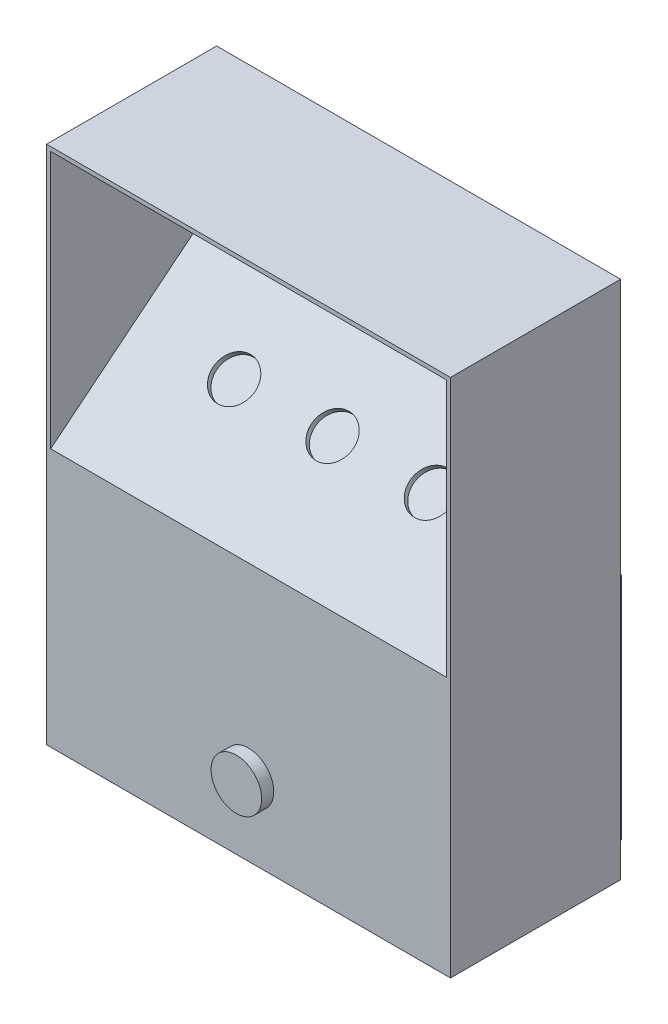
ISO-10303-21;
HEADER;
FILE_DESCRIPTION(('STEP AP214'),'2;1');
FILE_NAME('part.step','',(''),(''),'','','');
FILE_SCHEMA(('AUTOMOTIVE_DESIGN { 1 0 10303 214 1 1 1 1 }'));
ENDSEC;
DATA;
#1=APPLICATION_CONTEXT('core data for automotive mechanical design processes');
#2=APPLICATION_PROTOCOL_DEFINITION('international standard','automotive_design',2000,#1);
#3=PRODUCT_CONTEXT('',#1,'mechanical');
#4=PRODUCT('Part','Part','',(#3));
#5=PRODUCT_RELATED_PRODUCT_CATEGORY('part','',(#4));
#6=PRODUCT_DEFINITION_FORMATION('','',#4);
#7=PRODUCT_DEFINITION_CONTEXT('part definition',#1,'design');
#8=PRODUCT_DEFINITION('design','',#6,#7);
#9=PRODUCT_DEFINITION_SHAPE('','',#8);
#10=(LENGTH_UNIT() NAMED_UNIT(*) SI_UNIT(.MILLI.,.METRE.));
#11=(NAMED_UNIT(*) PLANE_ANGLE_UNIT() SI_UNIT($,.RADIAN.));
#12=(NAMED_UNIT(*) SI_UNIT($,.STERADIAN.) SOLID_ANGLE_UNIT());
#13=UNCERTAINTY_MEASURE_WITH_UNIT(LENGTH_MEASURE(1.E-05),#10,'distance_accuracy_value','');
#14=(GEOMETRIC_REPRESENTATION_CONTEXT(3) GLOBAL_UNCERTAINTY_ASSIGNED_CONTEXT((#13)) GLOBAL_UNIT_ASSIGNED_CONTEXT((#10,
#11,#12)) REPRESENTATION_CONTEXT('',''));
#15=CARTESIAN_POINT('',(0.,0.,0.));
#16=DIRECTION('',(0.,0.,1.));
#17=DIRECTION('',(1.,0.,0.));
#18=AXIS2_PLACEMENT_3D('',#15,#16,#17);
#19=CARTESIAN_POINT('',(0.,0.,0.));
#20=DIRECTION('',(0.,0.,1.));
#21=DIRECTION('',(1.,0.,0.));
#22=AXIS2_PLACEMENT_3D('',#19,#20,#21);
#23=PLANE('',#22);
#24=DIRECTION('',(0.,-1.,0.));
#25=VECTOR('',#24,1.);
#26=CARTESIAN_POINT('',(75.7809,103.555799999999,0.));
#27=LINE('',#26,#25);
#28=CARTESIAN_POINT('',(75.7809,103.555799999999,0.));
#29=VERTEX_POINT('',#28);
#30=CARTESIAN_POINT('',(75.7809,0.,0.));
#31=VERTEX_POINT('',#30);
#32=EDGE_CURVE('E69',#29,#31,#27,.T.);
#33=ORIENTED_EDGE('',*,*,#32,.F.);
#34=DIRECTION('',(1.,0.,0.));
#35=VECTOR('',#34,1.);
#36=CARTESIAN_POINT('',(75.7809,103.555799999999,0.));
#37=LINE('',#36,#35);
#38=CARTESIAN_POINT('',(-75.7809,103.555799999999,0.));
#39=VERTEX_POINT('',#38);
#40=EDGE_CURVE('E219',#39,#29,#37,.T.);
#41=ORIENTED_EDGE('',*,*,#40,.F.);
#42=DIRECTION('',(0.,1.,0.));
#43=VECTOR('',#42,1.);
#44=CARTESIAN_POINT('',(-75.7809,103.555799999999,0.));
#45=LINE('',#44,#43);
#46=CARTESIAN_POINT('',(-75.7809,0.,0.));
#47=VERTEX_POINT('',#46);
#48=EDGE_CURVE('E231',#47,#39,#45,.T.);
#49=ORIENTED_EDGE('',*,*,#48,.F.);
#50=DIRECTION('',(1.,0.,0.));
#51=VECTOR('',#50,1.);
#52=CARTESIAN_POINT('',(-91.2368,0.,0.));
#53=LINE('',#52,#51);
#54=CARTESIAN_POINT('',(-91.2368,0.,0.));
#55=VERTEX_POINT('',#54);
#56=EDGE_CURVE('E272',#55,#47,#53,.T.);
#57=ORIENTED_EDGE('',*,*,#56,.F.);
#58=DIRECTION('',(0.,-1.,0.));
#59=VECTOR('',#58,1.);
#60=CARTESIAN_POINT('',(-91.2368,234.95,0.));
#61=LINE('',#60,#59);
#62=CARTESIAN_POINT('',(-91.2368,234.95,0.));
#63=VERTEX_POINT('',#62);
#64=EDGE_CURVE('E252',#63,#55,#61,.T.);
#65=ORIENTED_EDGE('',*,*,#64,.F.);
#66=DIRECTION('',(-1.,0.,0.));
#67=VECTOR('',#66,1.);
#68=CARTESIAN_POINT('',(-91.2368,234.95,0.));
#69=LINE('',#68,#67);
#70=CARTESIAN_POINT('',(91.2368,234.95,0.));
#71=VERTEX_POINT('',#70);
#72=EDGE_CURVE('E258',#71,#63,#69,.T.);
#73=ORIENTED_EDGE('',*,*,#72,.F.);
#74=DIRECTION('',(0.,1.,0.));
#75=VECTOR('',#74,1.);
#76=CARTESIAN_POINT('',(91.2368,234.95,0.));
#77=LINE('',#76,#75);
#78=CARTESIAN_POINT('',(91.2368,0.,0.));
#79=VERTEX_POINT('',#78);
#80=EDGE_CURVE('E276',#79,#71,#77,.T.);
#81=ORIENTED_EDGE('',*,*,#80,.F.);
#82=EDGE_CURVE('E271',#31,#79,#53,.T.);
#83=ORIENTED_EDGE('',*,*,#82,.F.);
#84=EDGE_LOOP('',(#33,#41,#49,#57,#65,#73,#81,#83));
#85=FACE_BOUND('',#84,.T.);
#86=ADVANCED_FACE('F39',(#85),#23,.F.);
#87=CARTESIAN_POINT('',(-91.2368,234.95,76.835));
#88=DIRECTION('',(1.,0.,0.));
#89=DIRECTION('',(0.,1.,0.));
#90=AXIS2_PLACEMENT_3D('',#87,#88,#89);
#91=PLANE('',#90);
#92=ORIENTED_EDGE('',*,*,#64,.T.);
#93=DIRECTION('',(0.,0.,-1.));
#94=VECTOR('',#93,1.);
#95=CARTESIAN_POINT('',(-91.2368,0.,76.835));
#96=LINE('',#95,#94);
#97=CARTESIAN_POINT('',(-91.2368,0.,76.835));
#98=VERTEX_POINT('',#97);
#99=EDGE_CURVE('E11',#98,#55,#96,.T.);
#100=ORIENTED_EDGE('',*,*,#99,.F.);
#101=DIRECTION('',(0.,-1.,0.));
#102=VECTOR('',#101,1.);
#103=CARTESIAN_POINT('',(-91.2368,234.95,76.835));
#104=LINE('',#103,#102);
#105=CARTESIAN_POINT('',(-91.2368,234.95,76.835));
#106=VERTEX_POINT('',#105);
#107=EDGE_CURVE('E253',#106,#98,#104,.T.);
#108=ORIENTED_EDGE('',*,*,#107,.F.);
#109=DIRECTION('',(0.,0.,-1.));
#110=VECTOR('',#109,1.);
#111=CARTESIAN_POINT('',(-91.2368,234.95,76.835));
#112=LINE('',#111,#110);
#113=EDGE_CURVE('E267',#106,#63,#112,.T.);
#114=ORIENTED_EDGE('',*,*,#113,.T.);
#115=EDGE_LOOP('',(#92,#100,#108,#114));
#116=FACE_BOUND('',#115,.T.);
#117=ADVANCED_FACE('F41',(#116),#91,.F.);
#118=CARTESIAN_POINT('',(-91.2368,0.,76.835));
#119=DIRECTION('',(0.,1.,0.));
#120=DIRECTION('',(0.,0.,1.));
#121=AXIS2_PLACEMENT_3D('',#118,#119,#120);
#122=PLANE('',#121);
#123=ORIENTED_EDGE('',*,*,#56,.T.);
#124=DIRECTION('',(0.,0.,1.));
#125=VECTOR('',#124,1.);
#126=CARTESIAN_POINT('',(-75.7809,0.,-15.8496));
#127=LINE('',#126,#125);
#128=CARTESIAN_POINT('',(-75.7809,0.,-15.8496));
#129=VERTEX_POINT('',#128);
#130=EDGE_CURVE('E244',#129,#47,#127,.T.);
#131=ORIENTED_EDGE('',*,*,#130,.F.);
#132=DIRECTION('',(-1.,0.,0.));
#133=VECTOR('',#132,1.);
#134=CARTESIAN_POINT('',(75.7809,0.,-15.8496));
#135=LINE('',#134,#133);
#136=CARTESIAN_POINT('',(75.7809,0.,-15.8496));
#137=VERTEX_POINT('',#136);
#138=EDGE_CURVE('E218',#137,#129,#135,.T.);
#139=ORIENTED_EDGE('',*,*,#138,.F.);
#140=DIRECTION('',(0.,0.,1.));
#141=VECTOR('',#140,1.);
#142=CARTESIAN_POINT('',(75.7809,0.,-15.8496));
#143=LINE('',#142,#141);
#144=EDGE_CURVE('E248',#137,#31,#143,.T.);
#145=ORIENTED_EDGE('',*,*,#144,.T.);
#146=ORIENTED_EDGE('',*,*,#82,.T.);
#147=DIRECTION('',(0.,0.,-1.));
#148=VECTOR('',#147,1.);
#149=CARTESIAN_POINT('',(91.2368,0.,76.835));
#150=LINE('',#149,#148);
#151=CARTESIAN_POINT('',(91.2368,0.,76.835));
#152=VERTEX_POINT('',#151);
#153=EDGE_CURVE('E48',#152,#79,#150,.T.);
#154=ORIENTED_EDGE('',*,*,#153,.F.);
#155=DIRECTION('',(1.,0.,0.));
#156=VECTOR('',#155,1.);
#157=CARTESIAN_POINT('',(-91.2368,0.,76.835));
#158=LINE('',#157,#156);
#159=EDGE_CURVE('E257',#98,#152,#158,.T.);
#160=ORIENTED_EDGE('',*,*,#159,.F.);
#161=ORIENTED_EDGE('',*,*,#99,.T.);
#162=EDGE_LOOP('',(#123,#131,#139,#145,#146,#154,#160,#161));
#163=FACE_BOUND('',#162,.T.);
#164=ADVANCED_FACE('F306',(#163),#122,.F.);
#165=CARTESIAN_POINT('',(91.2368,234.95,76.835));
#166=DIRECTION('',(-1.,0.,0.));
#167=DIRECTION('',(0.,-1.,0.));
#168=AXIS2_PLACEMENT_3D('',#165,#166,#167);
#169=PLANE('',#168);
#170=ORIENTED_EDGE('',*,*,#80,.T.);
#171=DIRECTION('',(0.,0.,-1.));
#172=VECTOR('',#171,1.);
#173=CARTESIAN_POINT('',(91.2368,234.95,76.835));
#174=LINE('',#173,#172);
#175=CARTESIAN_POINT('',(91.2368,234.95,76.835));
#176=VERTEX_POINT('',#175);
#177=EDGE_CURVE('E284',#176,#71,#174,.T.);
#178=ORIENTED_EDGE('',*,*,#177,.F.);
#179=DIRECTION('',(0.,1.,0.));
#180=VECTOR('',#179,1.);
#181=CARTESIAN_POINT('',(91.2368,234.95,76.835));
#182=LINE('',#181,#180);
#183=EDGE_CURVE('E261',#152,#176,#182,.T.);
#184=ORIENTED_EDGE('',*,*,#183,.F.);
#185=ORIENTED_EDGE('',*,*,#153,.T.);
#186=EDGE_LOOP('',(#170,#178,#184,#185));
#187=FACE_BOUND('',#186,.T.);
#188=ADVANCED_FACE('F294',(#187),#169,.F.);
#189=CARTESIAN_POINT('',(-91.2368,234.95,76.835));
#190=DIRECTION('',(0.,-1.,0.));
#191=DIRECTION('',(1.,0.,0.));
#192=AXIS2_PLACEMENT_3D('',#189,#190,#191);
#193=PLANE('',#192);
#194=ORIENTED_EDGE('',*,*,#72,.T.);
#195=ORIENTED_EDGE('',*,*,#113,.F.);
#196=DIRECTION('',(-1.,0.,0.));
#197=VECTOR('',#196,1.);
#198=CARTESIAN_POINT('',(-91.2368,234.95,76.835));
#199=LINE('',#198,#197);
#200=EDGE_CURVE('E264',#176,#106,#199,.T.);
#201=ORIENTED_EDGE('',*,*,#200,.F.);
#202=ORIENTED_EDGE('',*,*,#177,.T.);
#203=EDGE_LOOP('',(#194,#195,#201,#202));
#204=FACE_BOUND('',#203,.T.);
#205=ADVANCED_FACE('F301',(#204),#193,.F.);
#206=CARTESIAN_POINT('',(0.,0.,76.835));
#207=DIRECTION('',(0.,0.,1.));
#208=DIRECTION('',(1.,0.,0.));
#209=AXIS2_PLACEMENT_3D('',#206,#207,#208);
#210=PLANE('',#209);
#211=CARTESIAN_POINT('',(-0.0237999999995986,32.8921239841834,76.835));
#212=DIRECTION('',(0.,0.,1.));
#213=DIRECTION('',(1.,0.,0.));
#214=AXIS2_PLACEMENT_3D('',#211,#212,#213);
#215=CIRCLE('',#214,11.4300000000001);
#216=CARTESIAN_POINT('',(11.4062000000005,32.8921239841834,76.835));
#217=VERTEX_POINT('',#216);
#218=EDGE_CURVE('E691',#217,#217,#215,.T.);
#219=ORIENTED_EDGE('',*,*,#218,.F.);
#220=EDGE_LOOP('',(#219));
#221=FACE_BOUND('',#220,.T.);
#222=DIRECTION('',(0.,-1.,0.));
#223=VECTOR('',#222,1.);
#224=CARTESIAN_POINT('',(-89.3572,116.72737253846,76.835));
#225=LINE('',#224,#223);
#226=CARTESIAN_POINT('',(-89.3572,233.0704,76.835));
#227=VERTEX_POINT('',#226);
#228=CARTESIAN_POINT('',(-89.3572,116.72737253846,76.835));
#229=VERTEX_POINT('',#228);
#230=EDGE_CURVE('E177',#227,#229,#225,.T.);
#231=ORIENTED_EDGE('',*,*,#230,.F.);
#232=DIRECTION('',(1.,0.,0.));
#233=VECTOR('',#232,1.);
#234=CARTESIAN_POINT('',(-89.3572,233.0704,76.835));
#235=LINE('',#234,#233);
#236=CARTESIAN_POINT('',(89.3572,233.0704,76.835));
#237=VERTEX_POINT('',#236);
#238=EDGE_CURVE('E159',#227,#237,#235,.T.);
#239=ORIENTED_EDGE('',*,*,#238,.T.);
#240=DIRECTION('',(0.,-1.,0.));
#241=VECTOR('',#240,1.);
#242=CARTESIAN_POINT('',(89.3572,116.72737253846,76.835));
#243=LINE('',#242,#241);
#244=CARTESIAN_POINT('',(89.3572,116.72737253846,76.835));
#245=VERTEX_POINT('',#244);
#246=EDGE_CURVE('E197',#237,#245,#243,.T.);
#247=ORIENTED_EDGE('',*,*,#246,.T.);
#248=DIRECTION('',(1.,0.,0.));
#249=VECTOR('',#248,1.);
#250=CARTESIAN_POINT('',(-89.3572,116.72737253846,76.835));
#251=LINE('',#250,#249);
#252=EDGE_CURVE('E170',#229,#245,#251,.T.);
#253=ORIENTED_EDGE('',*,*,#252,.F.);
#254=EDGE_LOOP('',(#231,#239,#247,#253));
#255=FACE_BOUND('',#254,.T.);
#256=ORIENTED_EDGE('',*,*,#107,.T.);
#257=ORIENTED_EDGE('',*,*,#159,.T.);
#258=ORIENTED_EDGE('',*,*,#183,.T.);
#259=ORIENTED_EDGE('',*,*,#200,.T.);
#260=EDGE_LOOP('',(#256,#257,#258,#259));
#261=FACE_BOUND('',#260,.T.);
#262=ADVANCED_FACE('F183',(#221,#255,#261),#210,.T.);
#263=CARTESIAN_POINT('',(75.7809,103.555799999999,-15.8496));
#264=DIRECTION('',(-1.,0.,0.));
#265=DIRECTION('',(0.,0.,1.));
#266=AXIS2_PLACEMENT_3D('',#263,#264,#265);
#267=PLANE('',#266);
#268=ORIENTED_EDGE('',*,*,#32,.T.);
#269=ORIENTED_EDGE('',*,*,#144,.F.);
#270=DIRECTION('',(0.,-1.,0.));
#271=VECTOR('',#270,1.);
#272=CARTESIAN_POINT('',(75.7809,103.555799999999,-15.8496));
#273=LINE('',#272,#271);
#274=CARTESIAN_POINT('',(75.7809,103.555799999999,-15.8496));
#275=VERTEX_POINT('',#274);
#276=EDGE_CURVE('E214',#275,#137,#273,.T.);
#277=ORIENTED_EDGE('',*,*,#276,.F.);
#278=DIRECTION('',(0.,0.,1.));
#279=VECTOR('',#278,1.);
#280=CARTESIAN_POINT('',(75.7809,103.555799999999,-15.8496));
#281=LINE('',#280,#279);
#282=EDGE_CURVE('E228',#275,#29,#281,.T.);
#283=ORIENTED_EDGE('',*,*,#282,.T.);
#284=EDGE_LOOP('',(#268,#269,#277,#283));
#285=FACE_BOUND('',#284,.T.);
#286=ADVANCED_FACE('F319',(#285),#267,.F.);
#287=CARTESIAN_POINT('',(-75.7809,103.555799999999,-15.8496));
#288=DIRECTION('',(1.,0.,0.));
#289=DIRECTION('',(0.,1.,0.));
#290=AXIS2_PLACEMENT_3D('',#287,#288,#289);
#291=PLANE('',#290);
#292=ORIENTED_EDGE('',*,*,#48,.T.);
#293=DIRECTION('',(0.,0.,1.));
#294=VECTOR('',#293,1.);
#295=CARTESIAN_POINT('',(-75.7809,103.555799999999,-15.8496));
#296=LINE('',#295,#294);
#297=CARTESIAN_POINT('',(-75.7809,103.555799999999,-15.8496));
#298=VERTEX_POINT('',#297);
#299=EDGE_CURVE('E240',#298,#39,#296,.T.);
#300=ORIENTED_EDGE('',*,*,#299,.F.);
#301=DIRECTION('',(0.,1.,0.));
#302=VECTOR('',#301,1.);
#303=CARTESIAN_POINT('',(-75.7809,103.555799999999,-15.8496));
#304=LINE('',#303,#302);
#305=EDGE_CURVE('E222',#129,#298,#304,.T.);
#306=ORIENTED_EDGE('',*,*,#305,.F.);
#307=ORIENTED_EDGE('',*,*,#130,.T.);
#308=EDGE_LOOP('',(#292,#300,#306,#307));
#309=FACE_BOUND('',#308,.T.);
#310=ADVANCED_FACE('F310',(#309),#291,.F.);
#311=CARTESIAN_POINT('',(75.7809,103.555799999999,-15.8496));
#312=DIRECTION('',(0.,-1.,0.));
#313=DIRECTION('',(1.,0.,0.));
#314=AXIS2_PLACEMENT_3D('',#311,#312,#313);
#315=PLANE('',#314);
#316=ORIENTED_EDGE('',*,*,#40,.T.);
#317=ORIENTED_EDGE('',*,*,#282,.F.);
#318=DIRECTION('',(1.,0.,0.));
#319=VECTOR('',#318,1.);
#320=CARTESIAN_POINT('',(75.7809,103.555799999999,-15.8496));
#321=LINE('',#320,#319);
#322=EDGE_CURVE('E225',#298,#275,#321,.T.);
#323=ORIENTED_EDGE('',*,*,#322,.F.);
#324=ORIENTED_EDGE('',*,*,#299,.T.);
#325=EDGE_LOOP('',(#316,#317,#323,#324));
#326=FACE_BOUND('',#325,.T.);
#327=ADVANCED_FACE('F321',(#326),#315,.F.);
#328=CARTESIAN_POINT('',(0.,0.,-15.8496));
#329=DIRECTION('',(0.,0.,-1.));
#330=DIRECTION('',(-1.,0.,0.));
#331=AXIS2_PLACEMENT_3D('',#328,#329,#330);
#332=PLANE('',#331);
#333=CARTESIAN_POINT('',(57.1499999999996,14.1224000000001,-15.8496));
#334=DIRECTION('',(0.,0.,-1.));
#335=DIRECTION('',(1.,0.,0.));
#336=AXIS2_PLACEMENT_3D('',#333,#334,#335);
#337=CIRCLE('',#336,2.54);
#338=CARTESIAN_POINT('',(59.6899999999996,14.1224000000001,-15.8496));
#339=VERTEX_POINT('',#338);
#340=EDGE_CURVE('E690',#339,#339,#337,.T.);
#341=ORIENTED_EDGE('',*,*,#340,.F.);
#342=EDGE_LOOP('',(#341));
#343=FACE_BOUND('',#342,.T.);
#344=CARTESIAN_POINT('',(57.1499999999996,90.3224000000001,-15.8496));
#345=DIRECTION('',(0.,0.,-1.));
#346=DIRECTION('',(1.,0.,0.));
#347=AXIS2_PLACEMENT_3D('',#344,#345,#346);
#348=CIRCLE('',#347,2.53999999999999);
#349=CARTESIAN_POINT('',(59.6899999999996,90.3224000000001,-15.8496));
#350=VERTEX_POINT('',#349);
#351=EDGE_CURVE('E714',#350,#350,#348,.T.);
#352=ORIENTED_EDGE('',*,*,#351,.F.);
#353=EDGE_LOOP('',(#352));
#354=FACE_BOUND('',#353,.T.);
#355=CARTESIAN_POINT('',(-57.1499999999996,90.3224000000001,-15.8496));
#356=DIRECTION('',(0.,0.,-1.));
#357=DIRECTION('',(-1.,0.,0.));
#358=AXIS2_PLACEMENT_3D('',#355,#356,#357);
#359=CIRCLE('',#358,2.53999999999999);
#360=CARTESIAN_POINT('',(-59.6899999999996,90.3224000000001,-15.8496));
#361=VERTEX_POINT('',#360);
#362=EDGE_CURVE('E706',#361,#361,#359,.T.);
#363=ORIENTED_EDGE('',*,*,#362,.F.);
#364=EDGE_LOOP('',(#363));
#365=FACE_BOUND('',#364,.T.);
#366=CARTESIAN_POINT('',(-57.1499999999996,14.1224000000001,-15.8496));
#367=DIRECTION('',(0.,0.,-1.));
#368=DIRECTION('',(-1.,0.,0.));
#369=AXIS2_PLACEMENT_3D('',#366,#367,#368);
#370=CIRCLE('',#369,2.54);
#371=CARTESIAN_POINT('',(-59.6899999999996,14.1224000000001,-15.8496));
#372=VERTEX_POINT('',#371);
#373=EDGE_CURVE('E705',#372,#372,#370,.T.);
#374=ORIENTED_EDGE('',*,*,#373,.F.);
#375=EDGE_LOOP('',(#374));
#376=FACE_BOUND('',#375,.T.);
#377=ORIENTED_EDGE('',*,*,#276,.T.);
#378=ORIENTED_EDGE('',*,*,#138,.T.);
#379=ORIENTED_EDGE('',*,*,#305,.T.);
#380=ORIENTED_EDGE('',*,*,#322,.T.);
#381=EDGE_LOOP('',(#377,#378,#379,#380));
#382=FACE_BOUND('',#381,.T.);
#383=ADVANCED_FACE('F314',(#343,#354,#365,#376,#382),#332,.T.);
#384=CARTESIAN_POINT('',(-89.3572,233.0704,0.939800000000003));
#385=DIRECTION('',(0.,1.,0.));
#386=DIRECTION('',(0.,0.,1.));
#387=AXIS2_PLACEMENT_3D('',#384,#385,#386);
#388=PLANE('',#387);
#389=DIRECTION('',(0.,0.,1.));
#390=VECTOR('',#389,1.);
#391=CARTESIAN_POINT('',(89.3572,233.0704,0.939800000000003));
#392=LINE('',#391,#390);
#393=CARTESIAN_POINT('',(89.3572,233.0704,0.939800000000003));
#394=VERTEX_POINT('',#393);
#395=EDGE_CURVE('E165',#394,#237,#392,.T.);
#396=ORIENTED_EDGE('',*,*,#395,.T.);
#397=ORIENTED_EDGE('',*,*,#238,.F.);
#398=DIRECTION('',(0.,0.,1.));
#399=VECTOR('',#398,1.);
#400=CARTESIAN_POINT('',(-89.3572,233.0704,0.939800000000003));
#401=LINE('',#400,#399);
#402=CARTESIAN_POINT('',(-89.3572,233.0704,0.939800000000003));
#403=VERTEX_POINT('',#402);
#404=EDGE_CURVE('E162',#403,#227,#401,.T.);
#405=ORIENTED_EDGE('',*,*,#404,.F.);
#406=DIRECTION('',(1.,0.,0.));
#407=VECTOR('',#406,1.);
#408=CARTESIAN_POINT('',(-89.3572,233.0704,0.939800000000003));
#409=LINE('',#408,#407);
#410=EDGE_CURVE('E206',#403,#394,#409,.T.);
#411=ORIENTED_EDGE('',*,*,#410,.T.);
#412=EDGE_LOOP('',(#396,#397,#405,#411));
#413=FACE_BOUND('',#412,.T.);
#414=ADVANCED_FACE('F161',(#413),#388,.F.);
#415=CARTESIAN_POINT('',(-89.3572,233.0704,0.939800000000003));
#416=DIRECTION('',(0.,0.,-1.));
#417=DIRECTION('',(0.,1.,0.));
#418=AXIS2_PLACEMENT_3D('',#415,#416,#417);
#419=PLANE('',#418);
#420=DIRECTION('',(0.,1.,0.));
#421=VECTOR('',#420,1.);
#422=CARTESIAN_POINT('',(89.3572,233.0704,0.939800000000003));
#423=LINE('',#422,#421);
#424=CARTESIAN_POINT('',(89.3572,178.186093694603,0.939799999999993));
#425=VERTEX_POINT('',#424);
#426=EDGE_CURVE('E181',#425,#394,#423,.T.);
#427=ORIENTED_EDGE('',*,*,#426,.T.);
#428=ORIENTED_EDGE('',*,*,#410,.F.);
#429=DIRECTION('',(0.,1.,0.));
#430=VECTOR('',#429,1.);
#431=CARTESIAN_POINT('',(-89.3572,233.0704,0.939800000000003));
#432=LINE('',#431,#430);
#433=CARTESIAN_POINT('',(-89.3572,178.186093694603,0.939799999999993));
#434=VERTEX_POINT('',#433);
#435=EDGE_CURVE('E171',#434,#403,#432,.T.);
#436=ORIENTED_EDGE('',*,*,#435,.F.);
#437=DIRECTION('',(1.,0.,0.));
#438=VECTOR('',#437,1.);
#439=CARTESIAN_POINT('',(-89.3572,178.186093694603,0.939799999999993));
#440=LINE('',#439,#438);
#441=EDGE_CURVE('E209',#434,#425,#440,.T.);
#442=ORIENTED_EDGE('',*,*,#441,.T.);
#443=EDGE_LOOP('',(#427,#428,#436,#442));
#444=FACE_BOUND('',#443,.T.);
#445=ADVANCED_FACE('F391',(#444),#419,.F.);
#446=CARTESIAN_POINT('',(-89.3572,178.186093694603,0.939799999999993));
#447=DIRECTION('',(0.,-0.777145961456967,-0.629320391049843));
#448=DIRECTION('',(0.,0.629320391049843,-0.777145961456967));
#449=AXIS2_PLACEMENT_3D('',#446,#447,#448);
#450=PLANE('',#449);
#451=CARTESIAN_POINT('',(-44.4500000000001,147.456733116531,38.8874));
#452=DIRECTION('',(0.,0.777145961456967,0.629320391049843));
#453=DIRECTION('',(0.,-0.629320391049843,0.777145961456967));
#454=AXIS2_PLACEMENT_3D('',#451,#452,#453);
#455=CIRCLE('',#454,9.52500000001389);
#456=CARTESIAN_POINT('',(-44.4500000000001,141.462456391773,46.2897152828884));
#457=VERTEX_POINT('',#456);
#458=EDGE_CURVE('E732',#457,#457,#455,.T.);
#459=ORIENTED_EDGE('',*,*,#458,.F.);
#460=EDGE_LOOP('',(#459));
#461=FACE_BOUND('',#460,.T.);
#462=CARTESIAN_POINT('',(44.4499999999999,147.456733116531,38.8874));
#463=DIRECTION('',(0.,0.777145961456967,0.629320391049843));
#464=DIRECTION('',(0.,-0.629320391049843,0.777145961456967));
#465=AXIS2_PLACEMENT_3D('',#462,#463,#464);
#466=CIRCLE('',#465,9.52500000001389);
#467=CARTESIAN_POINT('',(44.4499999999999,141.462456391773,46.2897152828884));
#468=VERTEX_POINT('',#467);
#469=EDGE_CURVE('E740',#468,#468,#466,.T.);
#470=ORIENTED_EDGE('',*,*,#469,.F.);
#471=EDGE_LOOP('',(#470));
#472=FACE_BOUND('',#471,.T.);
#473=CARTESIAN_POINT('',(0.,147.456733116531,38.8874));
#474=DIRECTION('',(0.,0.777145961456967,0.629320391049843));
#475=DIRECTION('',(0.,-0.629320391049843,0.777145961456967));
#476=AXIS2_PLACEMENT_3D('',#473,#474,#475);
#477=CIRCLE('',#476,9.52500000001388);
#478=CARTESIAN_POINT('',(0.,141.462456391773,46.2897152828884));
#479=VERTEX_POINT('',#478);
#480=EDGE_CURVE('E725',#479,#479,#477,.T.);
#481=ORIENTED_EDGE('',*,*,#480,.F.);
#482=EDGE_LOOP('',(#481));
#483=FACE_BOUND('',#482,.T.);
#484=DIRECTION('',(0.,0.629320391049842,-0.777145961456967));
#485=VECTOR('',#484,1.);
#486=CARTESIAN_POINT('',(89.3572,178.186093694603,0.939799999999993));
#487=LINE('',#486,#485);
#488=EDGE_CURVE('E59',#245,#425,#487,.T.);
#489=ORIENTED_EDGE('',*,*,#488,.T.);
#490=ORIENTED_EDGE('',*,*,#441,.F.);
#491=DIRECTION('',(0.,0.629320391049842,-0.777145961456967));
#492=VECTOR('',#491,1.);
#493=CARTESIAN_POINT('',(-89.3572,178.186093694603,0.939799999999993));
#494=LINE('',#493,#492);
#495=EDGE_CURVE('E186',#229,#434,#494,.T.);
#496=ORIENTED_EDGE('',*,*,#495,.F.);
#497=ORIENTED_EDGE('',*,*,#252,.T.);
#498=EDGE_LOOP('',(#489,#490,#496,#497));
#499=FACE_BOUND('',#498,.T.);
#500=ADVANCED_FACE('F400',(#461,#472,#483,#499),#450,.F.);
#501=CARTESIAN_POINT('',(-89.3572,0.,0.));
#502=DIRECTION('',(-1.,0.,0.));
#503=DIRECTION('',(0.,0.,1.));
#504=AXIS2_PLACEMENT_3D('',#501,#502,#503);
#505=PLANE('',#504);
#506=ORIENTED_EDGE('',*,*,#404,.T.);
#507=ORIENTED_EDGE('',*,*,#230,.T.);
#508=ORIENTED_EDGE('',*,*,#495,.T.);
#509=ORIENTED_EDGE('',*,*,#435,.T.);
#510=EDGE_LOOP('',(#506,#507,#508,#509));
#511=FACE_BOUND('',#510,.T.);
#512=ADVANCED_FACE('F175',(#511),#505,.F.);
#513=CARTESIAN_POINT('',(89.3572,0.,0.));
#514=DIRECTION('',(-1.,0.,0.));
#515=DIRECTION('',(0.,0.,1.));
#516=AXIS2_PLACEMENT_3D('',#513,#514,#515);
#517=PLANE('',#516);
#518=ORIENTED_EDGE('',*,*,#395,.F.);
#519=ORIENTED_EDGE('',*,*,#426,.F.);
#520=ORIENTED_EDGE('',*,*,#488,.F.);
#521=ORIENTED_EDGE('',*,*,#246,.F.);
#522=EDGE_LOOP('',(#518,#519,#520,#521));
#523=FACE_BOUND('',#522,.T.);
#524=ADVANCED_FACE('F421',(#523),#517,.T.);
#525=CARTESIAN_POINT('',(0.,145.482782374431,37.2889262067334));
#526=DIRECTION('',(0.,0.777145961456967,0.629320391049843));
#527=DIRECTION('',(0.,-0.629320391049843,0.777145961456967));
#528=AXIS2_PLACEMENT_3D('',#525,#526,#527);
#529=CYLINDRICAL_SURFACE('',#528,9.52500000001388);
#530=CARTESIAN_POINT('',(0.,145.482782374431,37.2889262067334));
#531=DIRECTION('',(0.,0.777145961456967,0.629320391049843));
#532=DIRECTION('',(0.,-0.629320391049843,0.777145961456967));
#533=AXIS2_PLACEMENT_3D('',#530,#531,#532);
#534=CIRCLE('',#533,9.52500000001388);
#535=CARTESIAN_POINT('',(0.,139.488505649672,44.6912414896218));
#536=VERTEX_POINT('',#535);
#537=EDGE_CURVE('E744',#536,#536,#534,.T.);
#538=ORIENTED_EDGE('',*,*,#537,.F.);
#539=EDGE_LOOP('',(#538));
#540=FACE_BOUND('',#539,.T.);
#541=ORIENTED_EDGE('',*,*,#480,.T.);
#542=EDGE_LOOP('',(#541));
#543=FACE_BOUND('',#542,.T.);
#544=ADVANCED_FACE('F429',(#540,#543),#529,.F.);
#545=CARTESIAN_POINT('',(0.,145.482782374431,37.2889262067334));
#546=DIRECTION('',(0.,0.777145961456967,0.629320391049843));
#547=DIRECTION('',(0.,-0.629320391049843,0.777145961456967));
#548=AXIS2_PLACEMENT_3D('',#545,#546,#547);
#549=PLANE('',#548);
#550=ORIENTED_EDGE('',*,*,#537,.T.);
#551=EDGE_LOOP('',(#550));
#552=FACE_BOUND('',#551,.T.);
#553=ADVANCED_FACE('F437',(#552),#549,.T.);
#554=CARTESIAN_POINT('',(44.4499999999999,145.482782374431,37.2889262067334));
#555=DIRECTION('',(0.,0.777145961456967,0.629320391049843));
#556=DIRECTION('',(0.,-0.629320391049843,0.777145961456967));
#557=AXIS2_PLACEMENT_3D('',#554,#555,#556);
#558=CYLINDRICAL_SURFACE('',#557,9.52500000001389);
#559=CARTESIAN_POINT('',(44.4499999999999,145.482782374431,37.2889262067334));
#560=DIRECTION('',(0.,0.777145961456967,0.629320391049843));
#561=DIRECTION('',(0.,-0.629320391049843,0.777145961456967));
#562=AXIS2_PLACEMENT_3D('',#559,#560,#561);
#563=CIRCLE('',#562,9.52500000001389);
#564=CARTESIAN_POINT('',(44.4499999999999,139.488505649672,44.6912414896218));
#565=VERTEX_POINT('',#564);
#566=EDGE_CURVE('E736',#565,#565,#563,.T.);
#567=ORIENTED_EDGE('',*,*,#566,.F.);
#568=EDGE_LOOP('',(#567));
#569=FACE_BOUND('',#568,.T.);
#570=ORIENTED_EDGE('',*,*,#469,.T.);
#571=EDGE_LOOP('',(#570));
#572=FACE_BOUND('',#571,.T.);
#573=ADVANCED_FACE('F447',(#569,#572),#558,.F.);
#574=CARTESIAN_POINT('',(44.4499999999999,145.482782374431,37.2889262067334));
#575=DIRECTION('',(0.,0.777145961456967,0.629320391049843));
#576=DIRECTION('',(0.,-0.629320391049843,0.777145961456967));
#577=AXIS2_PLACEMENT_3D('',#574,#575,#576);
#578=PLANE('',#577);
#579=ORIENTED_EDGE('',*,*,#566,.T.);
#580=EDGE_LOOP('',(#579));
#581=FACE_BOUND('',#580,.T.);
#582=ADVANCED_FACE('F457',(#581),#578,.T.);
#583=CARTESIAN_POINT('',(-44.4500000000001,145.482782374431,37.2889262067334));
#584=DIRECTION('',(0.,0.777145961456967,0.629320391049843));
#585=DIRECTION('',(0.,-0.629320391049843,0.777145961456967));
#586=AXIS2_PLACEMENT_3D('',#583,#584,#585);
#587=CYLINDRICAL_SURFACE('',#586,9.52500000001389);
#588=CARTESIAN_POINT('',(-44.4500000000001,145.482782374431,37.2889262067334));
#589=DIRECTION('',(0.,0.777145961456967,0.629320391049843));
#590=DIRECTION('',(0.,-0.629320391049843,0.777145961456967));
#591=AXIS2_PLACEMENT_3D('',#588,#589,#590);
#592=CIRCLE('',#591,9.52500000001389);
#593=CARTESIAN_POINT('',(-44.4500000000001,139.488505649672,44.6912414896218));
#594=VERTEX_POINT('',#593);
#595=EDGE_CURVE('E198',#594,#594,#592,.T.);
#596=ORIENTED_EDGE('',*,*,#595,.F.);
#597=EDGE_LOOP('',(#596));
#598=FACE_BOUND('',#597,.T.);
#599=ORIENTED_EDGE('',*,*,#458,.T.);
#600=EDGE_LOOP('',(#599));
#601=FACE_BOUND('',#600,.T.);
#602=ADVANCED_FACE('F467',(#598,#601),#587,.F.);
#603=CARTESIAN_POINT('',(-44.4500000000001,145.482782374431,37.2889262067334));
#604=DIRECTION('',(0.,0.777145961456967,0.629320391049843));
#605=DIRECTION('',(0.,-0.629320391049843,0.777145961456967));
#606=AXIS2_PLACEMENT_3D('',#603,#604,#605);
#607=PLANE('',#606);
#608=ORIENTED_EDGE('',*,*,#595,.T.);
#609=EDGE_LOOP('',(#608));
#610=FACE_BOUND('',#609,.T.);
#611=ADVANCED_FACE('F477',(#610),#607,.T.);
#612=CARTESIAN_POINT('',(-57.1499999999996,14.1224000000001,-10.7696));
#613=DIRECTION('',(0.,0.,-1.));
#614=DIRECTION('',(-1.,0.,0.));
#615=AXIS2_PLACEMENT_3D('',#612,#613,#614);
#616=CYLINDRICAL_SURFACE('',#615,2.54);
#617=CARTESIAN_POINT('',(-57.1499999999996,14.1224000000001,-10.7696));
#618=DIRECTION('',(0.,0.,-1.));
#619=DIRECTION('',(-1.,0.,0.));
#620=AXIS2_PLACEMENT_3D('',#617,#618,#619);
#621=CIRCLE('',#620,2.54);
#622=CARTESIAN_POINT('',(-59.6899999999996,14.1224000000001,-10.7696));
#623=VERTEX_POINT('',#622);
#624=EDGE_CURVE('E721',#623,#623,#621,.T.);
#625=ORIENTED_EDGE('',*,*,#624,.F.);
#626=EDGE_LOOP('',(#625));
#627=FACE_BOUND('',#626,.T.);
#628=ORIENTED_EDGE('',*,*,#373,.T.);
#629=EDGE_LOOP('',(#628));
#630=FACE_BOUND('',#629,.T.);
#631=ADVANCED_FACE('F486',(#627,#630),#616,.F.);
#632=CARTESIAN_POINT('',(-57.1499999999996,14.1224000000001,-10.7696));
#633=DIRECTION('',(0.,0.,-1.));
#634=DIRECTION('',(-1.,0.,0.));
#635=AXIS2_PLACEMENT_3D('',#632,#633,#634);
#636=PLANE('',#635);
#637=ORIENTED_EDGE('',*,*,#624,.T.);
#638=EDGE_LOOP('',(#637));
#639=FACE_BOUND('',#638,.T.);
#640=ADVANCED_FACE('F495',(#639),#636,.T.);
#641=CARTESIAN_POINT('',(-57.1499999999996,90.3224000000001,-10.7696));
#642=DIRECTION('',(0.,0.,-1.));
#643=DIRECTION('',(-1.,0.,0.));
#644=AXIS2_PLACEMENT_3D('',#641,#642,#643);
#645=CYLINDRICAL_SURFACE('',#644,2.53999999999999);
#646=CARTESIAN_POINT('',(-57.1499999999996,90.3224000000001,-10.7696));
#647=DIRECTION('',(0.,0.,-1.));
#648=DIRECTION('',(-1.,0.,0.));
#649=AXIS2_PLACEMENT_3D('',#646,#647,#648);
#650=CIRCLE('',#649,2.53999999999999);
#651=CARTESIAN_POINT('',(-59.6899999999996,90.3224000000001,-10.7696));
#652=VERTEX_POINT('',#651);
#653=EDGE_CURVE('E701',#652,#652,#650,.T.);
#654=ORIENTED_EDGE('',*,*,#653,.F.);
#655=EDGE_LOOP('',(#654));
#656=FACE_BOUND('',#655,.T.);
#657=ORIENTED_EDGE('',*,*,#362,.T.);
#658=EDGE_LOOP('',(#657));
#659=FACE_BOUND('',#658,.T.);
#660=ADVANCED_FACE('F505',(#656,#659),#645,.F.);
#661=CARTESIAN_POINT('',(-57.1499999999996,90.3224000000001,-10.7696));
#662=DIRECTION('',(0.,0.,-1.));
#663=DIRECTION('',(-1.,0.,0.));
#664=AXIS2_PLACEMENT_3D('',#661,#662,#663);
#665=PLANE('',#664);
#666=ORIENTED_EDGE('',*,*,#653,.T.);
#667=EDGE_LOOP('',(#666));
#668=FACE_BOUND('',#667,.T.);
#669=ADVANCED_FACE('F515',(#668),#665,.T.);
#670=CARTESIAN_POINT('',(57.1499999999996,90.3224000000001,-10.7696));
#671=DIRECTION('',(0.,0.,-1.));
#672=DIRECTION('',(-1.,0.,0.));
#673=AXIS2_PLACEMENT_3D('',#670,#671,#672);
#674=CYLINDRICAL_SURFACE('',#673,2.53999999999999);
#675=CARTESIAN_POINT('',(57.1499999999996,90.3224000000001,-10.7696));
#676=DIRECTION('',(0.,0.,-1.));
#677=DIRECTION('',(1.,0.,0.));
#678=AXIS2_PLACEMENT_3D('',#675,#676,#677);
#679=CIRCLE('',#678,2.53999999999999);
#680=CARTESIAN_POINT('',(59.6899999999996,90.3224000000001,-10.7696));
#681=VERTEX_POINT('',#680);
#682=EDGE_CURVE('E710',#681,#681,#679,.T.);
#683=ORIENTED_EDGE('',*,*,#682,.F.);
#684=EDGE_LOOP('',(#683));
#685=FACE_BOUND('',#684,.T.);
#686=ORIENTED_EDGE('',*,*,#351,.T.);
#687=EDGE_LOOP('',(#686));
#688=FACE_BOUND('',#687,.T.);
#689=ADVANCED_FACE('F525',(#685,#688),#674,.F.);
#690=CARTESIAN_POINT('',(57.1499999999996,90.3224000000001,-10.7696));
#691=DIRECTION('',(0.,0.,1.));
#692=DIRECTION('',(1.,0.,0.));
#693=AXIS2_PLACEMENT_3D('',#690,#691,#692);
#694=PLANE('',#693);
#695=ORIENTED_EDGE('',*,*,#682,.T.);
#696=EDGE_LOOP('',(#695));
#697=FACE_BOUND('',#696,.T.);
#698=ADVANCED_FACE('F535',(#697),#694,.F.);
#699=CARTESIAN_POINT('',(57.1499999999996,14.1224000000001,-10.7696));
#700=DIRECTION('',(0.,0.,-1.));
#701=DIRECTION('',(-1.,0.,0.));
#702=AXIS2_PLACEMENT_3D('',#699,#700,#701);
#703=CYLINDRICAL_SURFACE('',#702,2.54);
#704=CARTESIAN_POINT('',(57.1499999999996,14.1224000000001,-10.7696));
#705=DIRECTION('',(0.,0.,-1.));
#706=DIRECTION('',(1.,0.,0.));
#707=AXIS2_PLACEMENT_3D('',#704,#705,#706);
#708=CIRCLE('',#707,2.54);
#709=CARTESIAN_POINT('',(59.6899999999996,14.1224000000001,-10.7696));
#710=VERTEX_POINT('',#709);
#711=EDGE_CURVE('E696',#710,#710,#708,.T.);
#712=ORIENTED_EDGE('',*,*,#711,.F.);
#713=EDGE_LOOP('',(#712));
#714=FACE_BOUND('',#713,.T.);
#715=ORIENTED_EDGE('',*,*,#340,.T.);
#716=EDGE_LOOP('',(#715));
#717=FACE_BOUND('',#716,.T.);
#718=ADVANCED_FACE('F545',(#714,#717),#703,.F.);
#719=CARTESIAN_POINT('',(57.1499999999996,14.1224000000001,-10.7696));
#720=DIRECTION('',(0.,0.,1.));
#721=DIRECTION('',(1.,0.,0.));
#722=AXIS2_PLACEMENT_3D('',#719,#720,#721);
#723=PLANE('',#722);
#724=ORIENTED_EDGE('',*,*,#711,.T.);
#725=EDGE_LOOP('',(#724));
#726=FACE_BOUND('',#725,.T.);
#727=ADVANCED_FACE('F555',(#726),#723,.F.);
#728=CARTESIAN_POINT('',(-0.0237999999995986,32.8921239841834,82.3047957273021));
#729=DIRECTION('',(0.,0.,-1.));
#730=DIRECTION('',(-1.,0.,0.));
#731=AXIS2_PLACEMENT_3D('',#728,#729,#730);
#732=CYLINDRICAL_SURFACE('',#731,11.4300000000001);
#733=CARTESIAN_POINT('',(-0.0237999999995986,32.8921239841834,82.3047957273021));
#734=DIRECTION('',(0.,0.,1.));
#735=DIRECTION('',(1.,0.,0.));
#736=AXIS2_PLACEMENT_3D('',#733,#734,#735);
#737=CIRCLE('',#736,11.4300000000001);
#738=CARTESIAN_POINT('',(11.4062000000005,32.8921239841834,82.3047957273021));
#739=VERTEX_POINT('',#738);
#740=EDGE_CURVE('E688',#739,#739,#737,.T.);
#741=ORIENTED_EDGE('',*,*,#740,.F.);
#742=EDGE_LOOP('',(#741));
#743=FACE_BOUND('',#742,.T.);
#744=ORIENTED_EDGE('',*,*,#218,.T.);
#745=EDGE_LOOP('',(#744));
#746=FACE_BOUND('',#745,.T.);
#747=ADVANCED_FACE('F565',(#743,#746),#732,.T.);
#748=CARTESIAN_POINT('',(-0.0237999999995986,32.8921239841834,82.3047957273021));
#749=DIRECTION('',(0.,0.,1.));
#750=DIRECTION('',(1.,0.,0.));
#751=AXIS2_PLACEMENT_3D('',#748,#749,#750);
#752=PLANE('',#751);
#753=ORIENTED_EDGE('',*,*,#740,.T.);
#754=EDGE_LOOP('',(#753));
#755=FACE_BOUND('',#754,.T.);
#756=ADVANCED_FACE('F575',(#755),#752,.T.);
#757=CLOSED_SHELL('',(#86,#117,#164,#188,#205,#262,#286,#310,#327,#383,#414,#445,#500,#512,#524,
#544,#553,#573,#582,#602,#611,#631,#640,#660,#669,#689,#698,#718,#727,#747,#756));
#758=MANIFOLD_SOLID_BREP('B2',#757);
#759=ADVANCED_BREP_SHAPE_REPRESENTATION('',(#18,#758),#14);
#760=SHAPE_DEFINITION_REPRESENTATION(#9,#759);
ENDSEC;
END-ISO-10303-21;
